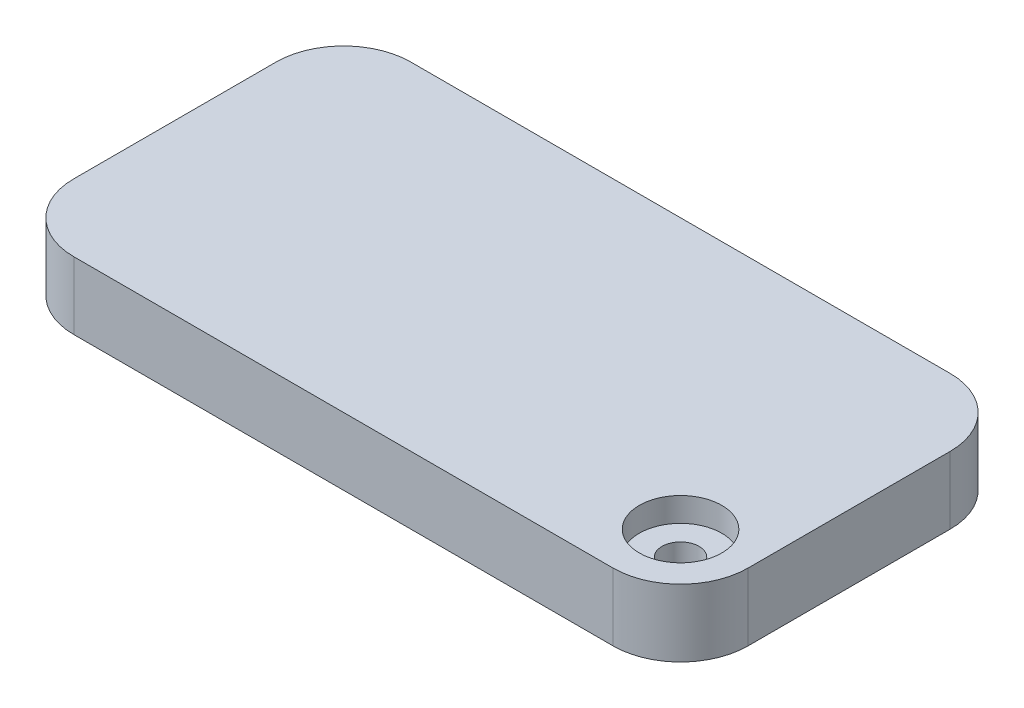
from build123d import *

# Parameters (mm, degrees)
EXTRUDE1_DEPTH                          = 10
CBORE_FOR_M5_HEX_HEAD_BOLT1_D           = 5.5
CBORE_FOR_M5_HEX_HEAD_BOLT1_CBORE_D     = 12.24
CBORE_FOR_M5_HEX_HEAD_BOLT1_CBORE_DEPTH = 3.58


with BuildPart() as part:
    # Sketch1 → Extrude1 (new body)
    with BuildSketch(Plane(origin=(0, 0, 0), x_dir=(1, 0, 0), z_dir=(0, 1, 0))):
        with BuildLine():
            Line((10, 0), (90, 0))
            ThreePointArc((90, 0), (97.071067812, 2.928932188), (100, 10))
            Line((100, 10), (100, 40))
            ThreePointArc((100, 40), (97.071067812, 47.071067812), (90, 50))
            Line((90, 50), (10, 50))
            ThreePointArc((10, 50), (2.928932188, 47.071067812), (0, 40))
            Line((0, 40), (0, 10))
            ThreePointArc((0, 10), (2.928932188, 2.928932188), (10, 0))
        make_face()
    extrude(amount=EXTRUDE1_DEPTH)

    # CBORE for M5 Hex Head Bolt1 (through all)
    with Locations(Plane(origin=(0, 10, 0), x_dir=(-1, 0, 0), z_dir=(0, 1, 0))):
        with Locations((-90, -10)):
            CounterBoreHole(CBORE_FOR_M5_HEX_HEAD_BOLT1_D / 2, CBORE_FOR_M5_HEX_HEAD_BOLT1_CBORE_D / 2, CBORE_FOR_M5_HEX_HEAD_BOLT1_CBORE_DEPTH)


solid = part.part
